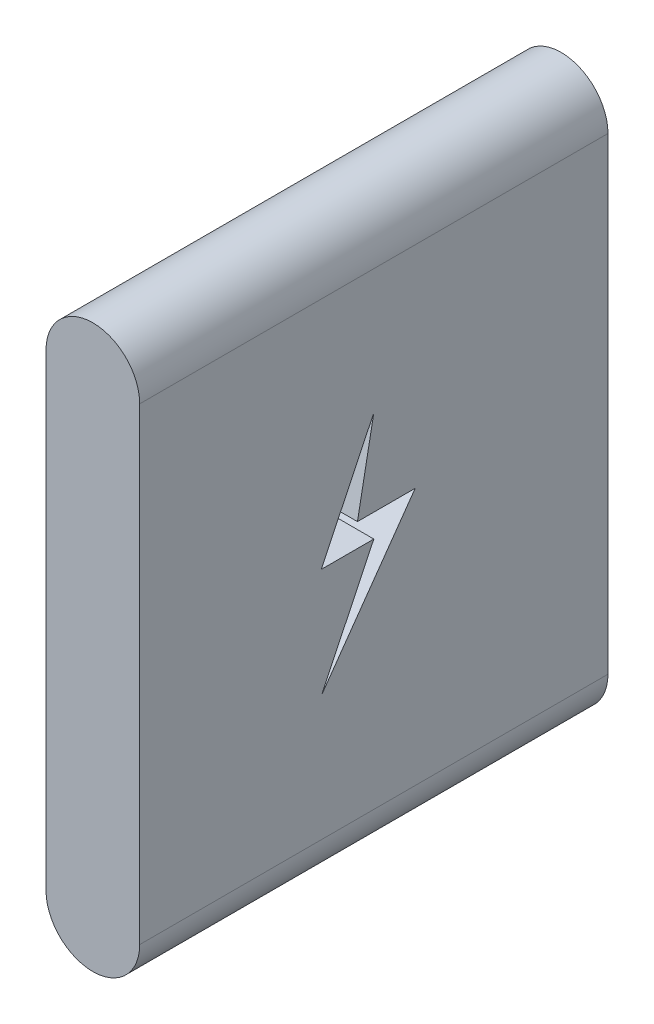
from build123d import *

# Parameters (mm, degrees)
BOSS_EXTRUDE1_DEPTH     = 100
CUT_EXTRUDE1_DEPTH      = 119.321595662
CUT_EXTRUDE1_DEPTH_BACK = 119.321595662


with BuildPart() as part:
    # Sketch1 → Boss-Extrude1 (new body)
    with BuildSketch(Plane.XY):
        with BuildLine():
            Line((-10, -50), (-10, 50))
            ThreePointArc((-10, 50), (0, 60), (10, 50))
            Line((10, 50), (10, -50))
            ThreePointArc((10, -50), (0, -60), (-10, -50))
        make_face()
    extrude(amount=BOSS_EXTRUDE1_DEPTH)

    # Sketch2 → Cut-Extrude1 (cut, two sides: drawn at the far end of the back side and taken through both)
    with BuildSketch(Plane(origin=(10, 0, 0), x_dir=(0, 0, -1), z_dir=(1, 0, 0)).offset(-CUT_EXTRUDE1_DEPTH_BACK)):
        Polygon((-53.497879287, 4.970670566), (-50, 23.380561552), (-61.230033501, 0), (-50, 0), (-61.230033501, -23.380561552), (-41.163252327, 4.970670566), align=None)
    extrude(amount=CUT_EXTRUDE1_DEPTH + CUT_EXTRUDE1_DEPTH_BACK, mode=Mode.SUBTRACT)


solid = part.part
